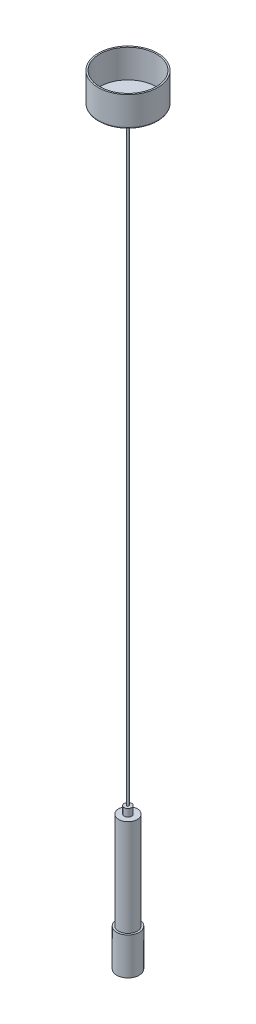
ISO-10303-21;
HEADER;
FILE_DESCRIPTION(('STEP AP214'),'2;1');
FILE_NAME('part.step','',(''),(''),'','','');
FILE_SCHEMA(('AUTOMOTIVE_DESIGN { 1 0 10303 214 1 1 1 1 }'));
ENDSEC;
DATA;
#1=APPLICATION_CONTEXT('core data for automotive mechanical design processes');
#2=APPLICATION_PROTOCOL_DEFINITION('international standard','automotive_design',2000,#1);
#3=PRODUCT_CONTEXT('',#1,'mechanical');
#4=PRODUCT('Part','Part','',(#3));
#5=PRODUCT_RELATED_PRODUCT_CATEGORY('part','',(#4));
#6=PRODUCT_DEFINITION_FORMATION('','',#4);
#7=PRODUCT_DEFINITION_CONTEXT('part definition',#1,'design');
#8=PRODUCT_DEFINITION('design','',#6,#7);
#9=PRODUCT_DEFINITION_SHAPE('','',#8);
#10=(LENGTH_UNIT() NAMED_UNIT(*) SI_UNIT(.MILLI.,.METRE.));
#11=(NAMED_UNIT(*) PLANE_ANGLE_UNIT() SI_UNIT($,.RADIAN.));
#12=(NAMED_UNIT(*) SI_UNIT($,.STERADIAN.) SOLID_ANGLE_UNIT());
#13=UNCERTAINTY_MEASURE_WITH_UNIT(LENGTH_MEASURE(1.E-05),#10,'distance_accuracy_value','');
#14=(GEOMETRIC_REPRESENTATION_CONTEXT(3) GLOBAL_UNCERTAINTY_ASSIGNED_CONTEXT((#13)) GLOBAL_UNIT_ASSIGNED_CONTEXT((#10,
#11,#12)) REPRESENTATION_CONTEXT('',''));
#15=CARTESIAN_POINT('',(0.,0.,0.));
#16=DIRECTION('',(0.,0.,1.));
#17=DIRECTION('',(1.,0.,0.));
#18=AXIS2_PLACEMENT_3D('',#15,#16,#17);
#19=CARTESIAN_POINT('',(0.,-50.,0.));
#20=DIRECTION('',(0.,1.,0.));
#21=DIRECTION('',(0.,0.,1.));
#22=AXIS2_PLACEMENT_3D('',#19,#20,#21);
#23=CYLINDRICAL_SURFACE('',#22,11.);
#24=CARTESIAN_POINT('',(0.,-50.,0.));
#25=DIRECTION('',(0.,-1.,0.));
#26=DIRECTION('',(0.,0.,-1.));
#27=AXIS2_PLACEMENT_3D('',#24,#25,#26);
#28=CIRCLE('',#27,11.);
#29=CARTESIAN_POINT('',(0.,-50.,-11.));
#30=VERTEX_POINT('',#29);
#31=EDGE_CURVE('E11',#30,#30,#28,.T.);
#32=ORIENTED_EDGE('',*,*,#31,.F.);
#33=EDGE_LOOP('',(#32));
#34=FACE_BOUND('',#33,.T.);
#35=CARTESIAN_POINT('',(0.,-47.,0.));
#36=DIRECTION('',(0.,-1.,0.));
#37=DIRECTION('',(0.,0.,-1.));
#38=AXIS2_PLACEMENT_3D('',#35,#36,#37);
#39=CIRCLE('',#38,11.);
#40=CARTESIAN_POINT('',(0.,-47.,-11.));
#41=VERTEX_POINT('',#40);
#42=EDGE_CURVE('E45',#41,#41,#39,.T.);
#43=ORIENTED_EDGE('',*,*,#42,.T.);
#44=EDGE_LOOP('',(#43));
#45=FACE_BOUND('',#44,.T.);
#46=ADVANCED_FACE('F42',(#34,#45),#23,.T.);
#47=CARTESIAN_POINT('',(0.,-50.,0.));
#48=DIRECTION('',(0.,-1.,0.));
#49=DIRECTION('',(0.,0.,-1.));
#50=AXIS2_PLACEMENT_3D('',#47,#48,#49);
#51=PLANE('',#50);
#52=ORIENTED_EDGE('',*,*,#31,.T.);
#53=EDGE_LOOP('',(#52));
#54=FACE_BOUND('',#53,.T.);
#55=ADVANCED_FACE('F57',(#54),#51,.T.);
#56=CARTESIAN_POINT('',(0.,-47.,0.));
#57=DIRECTION('',(0.,-1.,0.));
#58=DIRECTION('',(0.,0.,-1.));
#59=AXIS2_PLACEMENT_3D('',#56,#57,#58);
#60=PLANE('',#59);
#61=ORIENTED_EDGE('',*,*,#42,.F.);
#62=EDGE_LOOP('',(#61));
#63=FACE_BOUND('',#62,.T.);
#64=ADVANCED_FACE('F55',(#63),#60,.F.);
#65=CLOSED_SHELL('',(#46,#55,#64));
#66=MANIFOLD_SOLID_BREP('B2',#65);
#67=CARTESIAN_POINT('',(0.,995.,0.));
#68=DIRECTION('',(0.,-1.,0.));
#69=DIRECTION('',(0.,0.,-1.));
#70=AXIS2_PLACEMENT_3D('',#67,#68,#69);
#71=CYLINDRICAL_SURFACE('',#70,40.);
#72=CARTESIAN_POINT('',(0.,957.,0.));
#73=DIRECTION('',(0.,1.,0.));
#74=DIRECTION('',(0.,0.,1.));
#75=AXIS2_PLACEMENT_3D('',#72,#73,#74);
#76=CIRCLE('',#75,40.);
#77=CARTESIAN_POINT('',(0.,957.,40.));
#78=VERTEX_POINT('',#77);
#79=EDGE_CURVE('E97',#78,#78,#76,.T.);
#80=ORIENTED_EDGE('',*,*,#79,.T.);
#81=EDGE_LOOP('',(#80));
#82=FACE_BOUND('',#81,.T.);
#83=CARTESIAN_POINT('',(0.,995.,0.));
#84=DIRECTION('',(0.,1.,0.));
#85=DIRECTION('',(0.,0.,1.));
#86=AXIS2_PLACEMENT_3D('',#83,#84,#85);
#87=CIRCLE('',#86,40.);
#88=CARTESIAN_POINT('',(0.,995.,40.));
#89=VERTEX_POINT('',#88);
#90=EDGE_CURVE('E101',#89,#89,#87,.T.);
#91=ORIENTED_EDGE('',*,*,#90,.F.);
#92=EDGE_LOOP('',(#91));
#93=FACE_BOUND('',#92,.T.);
#94=ADVANCED_FACE('F90',(#82,#93),#71,.T.);
#95=CARTESIAN_POINT('',(0.,995.,0.));
#96=DIRECTION('',(0.,1.,0.));
#97=DIRECTION('',(0.,0.,1.));
#98=AXIS2_PLACEMENT_3D('',#95,#96,#97);
#99=PLANE('',#98);
#100=CARTESIAN_POINT('',(0.,995.,0.));
#101=DIRECTION('',(0.,1.,0.));
#102=DIRECTION('',(0.,0.,1.));
#103=AXIS2_PLACEMENT_3D('',#100,#101,#102);
#104=CIRCLE('',#103,38.);
#105=CARTESIAN_POINT('',(0.,995.,38.));
#106=VERTEX_POINT('',#105);
#107=EDGE_CURVE('E108',#106,#106,#104,.T.);
#108=ORIENTED_EDGE('',*,*,#107,.F.);
#109=EDGE_LOOP('',(#108));
#110=FACE_BOUND('',#109,.T.);
#111=ORIENTED_EDGE('',*,*,#90,.T.);
#112=EDGE_LOOP('',(#111));
#113=FACE_BOUND('',#112,.T.);
#114=ADVANCED_FACE('F122',(#110,#113),#99,.T.);
#115=CARTESIAN_POINT('',(0.,955.,0.));
#116=DIRECTION('',(0.,1.,0.));
#117=DIRECTION('',(0.,0.,1.));
#118=AXIS2_PLACEMENT_3D('',#115,#116,#117);
#119=PLANE('',#118);
#120=CARTESIAN_POINT('',(0.,955.,0.));
#121=DIRECTION('',(0.,1.,0.));
#122=DIRECTION('',(0.,0.,1.));
#123=AXIS2_PLACEMENT_3D('',#120,#121,#122);
#124=CIRCLE('',#123,38.);
#125=CARTESIAN_POINT('',(0.,955.,38.));
#126=VERTEX_POINT('',#125);
#127=EDGE_CURVE('E41',#126,#126,#124,.F.);
#128=ORIENTED_EDGE('',*,*,#127,.T.);
#129=EDGE_LOOP('',(#128));
#130=FACE_BOUND('',#129,.T.);
#131=ADVANCED_FACE('F125',(#130),#119,.F.);
#132=CARTESIAN_POINT('',(0.,957.,0.));
#133=DIRECTION('',(0.,1.,0.));
#134=DIRECTION('',(0.,0.,1.));
#135=AXIS2_PLACEMENT_3D('',#132,#133,#134);
#136=TOROIDAL_SURFACE('',#135,38.,2.);
#137=ORIENTED_EDGE('',*,*,#127,.F.);
#138=EDGE_LOOP('',(#137));
#139=FACE_BOUND('',#138,.T.);
#140=ORIENTED_EDGE('',*,*,#79,.F.);
#141=EDGE_LOOP('',(#140));
#142=FACE_BOUND('',#141,.T.);
#143=ADVANCED_FACE('F92',(#139,#142),#136,.T.);
#144=CARTESIAN_POINT('',(0.,995.,0.));
#145=DIRECTION('',(0.,-1.,0.));
#146=DIRECTION('',(0.,0.,-1.));
#147=AXIS2_PLACEMENT_3D('',#144,#145,#146);
#148=CYLINDRICAL_SURFACE('',#147,38.);
#149=CARTESIAN_POINT('',(0.,957.,0.));
#150=DIRECTION('',(0.,1.,0.));
#151=DIRECTION('',(0.,0.,1.));
#152=AXIS2_PLACEMENT_3D('',#149,#150,#151);
#153=CIRCLE('',#152,38.);
#154=CARTESIAN_POINT('',(0.,957.,38.));
#155=VERTEX_POINT('',#154);
#156=EDGE_CURVE('E105',#155,#155,#153,.T.);
#157=ORIENTED_EDGE('',*,*,#156,.F.);
#158=EDGE_LOOP('',(#157));
#159=FACE_BOUND('',#158,.T.);
#160=ORIENTED_EDGE('',*,*,#107,.T.);
#161=EDGE_LOOP('',(#160));
#162=FACE_BOUND('',#161,.T.);
#163=ADVANCED_FACE('F116',(#159,#162),#148,.F.);
#164=CARTESIAN_POINT('',(0.,957.,0.));
#165=DIRECTION('',(0.,1.,0.));
#166=DIRECTION('',(0.,0.,1.));
#167=AXIS2_PLACEMENT_3D('',#164,#165,#166);
#168=PLANE('',#167);
#169=ORIENTED_EDGE('',*,*,#156,.T.);
#170=EDGE_LOOP('',(#169));
#171=FACE_BOUND('',#170,.T.);
#172=ADVANCED_FACE('F114',(#171),#168,.T.);
#173=CLOSED_SHELL('',(#94,#114,#131,#143,#163,#172));
#174=MANIFOLD_SOLID_BREP('B6',#173);
#175=CARTESIAN_POINT('',(0.,955.,0.));
#176=DIRECTION('',(0.,-1.,0.));
#177=DIRECTION('',(0.,0.,-1.));
#178=AXIS2_PLACEMENT_3D('',#175,#176,#177);
#179=CYLINDRICAL_SURFACE('',#178,5.);
#180=CARTESIAN_POINT('',(0.,955.,0.));
#181=DIRECTION('',(0.,1.,0.));
#182=DIRECTION('',(0.,0.,1.));
#183=AXIS2_PLACEMENT_3D('',#180,#181,#182);
#184=CIRCLE('',#183,5.);
#185=CARTESIAN_POINT('',(0.,955.,5.));
#186=VERTEX_POINT('',#185);
#187=EDGE_CURVE('E89',#186,#186,#184,.T.);
#188=ORIENTED_EDGE('',*,*,#187,.F.);
#189=EDGE_LOOP('',(#188));
#190=FACE_BOUND('',#189,.T.);
#191=CARTESIAN_POINT('',(0.,940.,0.));
#192=DIRECTION('',(0.,1.,0.));
#193=DIRECTION('',(0.,0.,1.));
#194=AXIS2_PLACEMENT_3D('',#191,#192,#193);
#195=CIRCLE('',#194,5.);
#196=CARTESIAN_POINT('',(0.,940.,5.));
#197=VERTEX_POINT('',#196);
#198=EDGE_CURVE('E186',#197,#197,#195,.T.);
#199=ORIENTED_EDGE('',*,*,#198,.T.);
#200=EDGE_LOOP('',(#199));
#201=FACE_BOUND('',#200,.T.);
#202=ADVANCED_FACE('F183',(#190,#201),#179,.T.);
#203=CARTESIAN_POINT('',(0.,955.,0.));
#204=DIRECTION('',(0.,1.,0.));
#205=DIRECTION('',(0.,0.,1.));
#206=AXIS2_PLACEMENT_3D('',#203,#204,#205);
#207=PLANE('',#206);
#208=ORIENTED_EDGE('',*,*,#187,.T.);
#209=EDGE_LOOP('',(#208));
#210=FACE_BOUND('',#209,.T.);
#211=ADVANCED_FACE('F198',(#210),#207,.T.);
#212=CARTESIAN_POINT('',(0.,940.,0.));
#213=DIRECTION('',(0.,1.,0.));
#214=DIRECTION('',(0.,0.,1.));
#215=AXIS2_PLACEMENT_3D('',#212,#213,#214);
#216=PLANE('',#215);
#217=ORIENTED_EDGE('',*,*,#198,.F.);
#218=EDGE_LOOP('',(#217));
#219=FACE_BOUND('',#218,.T.);
#220=ADVANCED_FACE('F196',(#219),#216,.F.);
#221=CLOSED_SHELL('',(#202,#211,#220));
#222=MANIFOLD_SOLID_BREP('B36',#221);
#223=CARTESIAN_POINT('',(0.,940.,0.));
#224=DIRECTION('',(0.,-1.,0.));
#225=DIRECTION('',(0.,0.,-1.));
#226=AXIS2_PLACEMENT_3D('',#223,#224,#225);
#227=CYLINDRICAL_SURFACE('',#226,1.25);
#228=CARTESIAN_POINT('',(0.,940.,0.));
#229=DIRECTION('',(0.,1.,0.));
#230=DIRECTION('',(0.,0.,1.));
#231=AXIS2_PLACEMENT_3D('',#228,#229,#230);
#232=CIRCLE('',#231,1.25);
#233=CARTESIAN_POINT('',(0.,940.,1.25));
#234=VERTEX_POINT('',#233);
#235=EDGE_CURVE('E182',#234,#234,#232,.T.);
#236=ORIENTED_EDGE('',*,*,#235,.F.);
#237=EDGE_LOOP('',(#236));
#238=FACE_BOUND('',#237,.T.);
#239=CARTESIAN_POINT('',(0.,140.,0.));
#240=DIRECTION('',(0.,1.,0.));
#241=DIRECTION('',(0.,0.,1.));
#242=AXIS2_PLACEMENT_3D('',#239,#240,#241);
#243=CIRCLE('',#242,1.25);
#244=CARTESIAN_POINT('',(0.,140.,1.25));
#245=VERTEX_POINT('',#244);
#246=EDGE_CURVE('E234',#245,#245,#243,.T.);
#247=ORIENTED_EDGE('',*,*,#246,.T.);
#248=EDGE_LOOP('',(#247));
#249=FACE_BOUND('',#248,.T.);
#250=ADVANCED_FACE('F231',(#238,#249),#227,.T.);
#251=CARTESIAN_POINT('',(0.,940.,0.));
#252=DIRECTION('',(0.,1.,0.));
#253=DIRECTION('',(0.,0.,1.));
#254=AXIS2_PLACEMENT_3D('',#251,#252,#253);
#255=PLANE('',#254);
#256=ORIENTED_EDGE('',*,*,#235,.T.);
#257=EDGE_LOOP('',(#256));
#258=FACE_BOUND('',#257,.T.);
#259=ADVANCED_FACE('F246',(#258),#255,.T.);
#260=CARTESIAN_POINT('',(0.,140.,0.));
#261=DIRECTION('',(0.,1.,0.));
#262=DIRECTION('',(0.,0.,1.));
#263=AXIS2_PLACEMENT_3D('',#260,#261,#262);
#264=PLANE('',#263);
#265=ORIENTED_EDGE('',*,*,#246,.F.);
#266=EDGE_LOOP('',(#265));
#267=FACE_BOUND('',#266,.T.);
#268=ADVANCED_FACE('F244',(#267),#264,.F.);
#269=CLOSED_SHELL('',(#250,#259,#268));
#270=MANIFOLD_SOLID_BREP('B84',#269);
#271=CARTESIAN_POINT('',(0.,140.,0.));
#272=DIRECTION('',(0.,-1.,0.));
#273=DIRECTION('',(0.,0.,-1.));
#274=AXIS2_PLACEMENT_3D('',#271,#272,#273);
#275=CYLINDRICAL_SURFACE('',#274,5.);
#276=CARTESIAN_POINT('',(0.,140.,0.));
#277=DIRECTION('',(0.,1.,0.));
#278=DIRECTION('',(0.,0.,1.));
#279=AXIS2_PLACEMENT_3D('',#276,#277,#278);
#280=CIRCLE('',#279,5.);
#281=CARTESIAN_POINT('',(0.,140.,5.));
#282=VERTEX_POINT('',#281);
#283=EDGE_CURVE('E230',#282,#282,#280,.T.);
#284=ORIENTED_EDGE('',*,*,#283,.F.);
#285=EDGE_LOOP('',(#284));
#286=FACE_BOUND('',#285,.T.);
#287=CARTESIAN_POINT('',(0.,130.,0.));
#288=DIRECTION('',(0.,1.,0.));
#289=DIRECTION('',(0.,0.,1.));
#290=AXIS2_PLACEMENT_3D('',#287,#288,#289);
#291=CIRCLE('',#290,5.);
#292=CARTESIAN_POINT('',(0.,130.,5.));
#293=VERTEX_POINT('',#292);
#294=EDGE_CURVE('E282',#293,#293,#291,.T.);
#295=ORIENTED_EDGE('',*,*,#294,.T.);
#296=EDGE_LOOP('',(#295));
#297=FACE_BOUND('',#296,.T.);
#298=ADVANCED_FACE('F279',(#286,#297),#275,.T.);
#299=CARTESIAN_POINT('',(0.,140.,0.));
#300=DIRECTION('',(0.,1.,0.));
#301=DIRECTION('',(0.,0.,1.));
#302=AXIS2_PLACEMENT_3D('',#299,#300,#301);
#303=PLANE('',#302);
#304=ORIENTED_EDGE('',*,*,#283,.T.);
#305=EDGE_LOOP('',(#304));
#306=FACE_BOUND('',#305,.T.);
#307=ADVANCED_FACE('F294',(#306),#303,.T.);
#308=CARTESIAN_POINT('',(0.,130.,0.));
#309=DIRECTION('',(0.,1.,0.));
#310=DIRECTION('',(0.,0.,1.));
#311=AXIS2_PLACEMENT_3D('',#308,#309,#310);
#312=PLANE('',#311);
#313=ORIENTED_EDGE('',*,*,#294,.F.);
#314=EDGE_LOOP('',(#313));
#315=FACE_BOUND('',#314,.T.);
#316=ADVANCED_FACE('F292',(#315),#312,.F.);
#317=CLOSED_SHELL('',(#298,#307,#316));
#318=MANIFOLD_SOLID_BREP('B177',#317);
#319=CARTESIAN_POINT('',(0.,-50.,0.));
#320=DIRECTION('',(0.,1.,0.));
#321=DIRECTION('',(0.,0.,1.));
#322=AXIS2_PLACEMENT_3D('',#319,#320,#321);
#323=CYLINDRICAL_SURFACE('',#322,15.);
#324=CARTESIAN_POINT('',(0.,-50.,0.));
#325=DIRECTION('',(0.,-1.,0.));
#326=DIRECTION('',(0.,0.,-1.));
#327=AXIS2_PLACEMENT_3D('',#324,#325,#326);
#328=CIRCLE('',#327,15.);
#329=CARTESIAN_POINT('',(0.,-50.,-15.));
#330=VERTEX_POINT('',#329);
#331=EDGE_CURVE('E278',#330,#330,#328,.T.);
#332=ORIENTED_EDGE('',*,*,#331,.F.);
#333=EDGE_LOOP('',(#332));
#334=FACE_BOUND('',#333,.T.);
#335=CARTESIAN_POINT('',(0.,0.,0.));
#336=DIRECTION('',(0.,-1.,0.));
#337=DIRECTION('',(0.,0.,-1.));
#338=AXIS2_PLACEMENT_3D('',#335,#336,#337);
#339=CIRCLE('',#338,15.);
#340=CARTESIAN_POINT('',(0.,0.,-15.));
#341=VERTEX_POINT('',#340);
#342=EDGE_CURVE('E329',#341,#341,#339,.T.);
#343=ORIENTED_EDGE('',*,*,#342,.T.);
#344=EDGE_LOOP('',(#343));
#345=FACE_BOUND('',#344,.T.);
#346=ADVANCED_FACE('F326',(#334,#345),#323,.T.);
#347=CARTESIAN_POINT('',(0.,-50.,0.));
#348=DIRECTION('',(0.,-1.,0.));
#349=DIRECTION('',(0.,0.,-1.));
#350=AXIS2_PLACEMENT_3D('',#347,#348,#349);
#351=PLANE('',#350);
#352=CARTESIAN_POINT('',(0.,-50.,0.));
#353=DIRECTION('',(0.,-1.,0.));
#354=DIRECTION('',(0.,0.,-1.));
#355=AXIS2_PLACEMENT_3D('',#352,#353,#354);
#356=CIRCLE('',#355,11.);
#357=CARTESIAN_POINT('',(0.,-50.,-11.));
#358=VERTEX_POINT('',#357);
#359=EDGE_CURVE('E338',#358,#358,#356,.T.);
#360=ORIENTED_EDGE('',*,*,#359,.F.);
#361=EDGE_LOOP('',(#360));
#362=FACE_BOUND('',#361,.T.);
#363=ORIENTED_EDGE('',*,*,#331,.T.);
#364=EDGE_LOOP('',(#363));
#365=FACE_BOUND('',#364,.T.);
#366=ADVANCED_FACE('F353',(#362,#365),#351,.T.);
#367=CARTESIAN_POINT('',(0.,0.,0.));
#368=DIRECTION('',(0.,-1.,0.));
#369=DIRECTION('',(0.,0.,-1.));
#370=AXIS2_PLACEMENT_3D('',#367,#368,#369);
#371=PLANE('',#370);
#372=ORIENTED_EDGE('',*,*,#342,.F.);
#373=EDGE_LOOP('',(#372));
#374=FACE_BOUND('',#373,.T.);
#375=ADVANCED_FACE('F349',(#374),#371,.F.);
#376=CARTESIAN_POINT('',(0.,-47.,0.));
#377=DIRECTION('',(0.,-1.,0.));
#378=DIRECTION('',(0.,0.,-1.));
#379=AXIS2_PLACEMENT_3D('',#376,#377,#378);
#380=CYLINDRICAL_SURFACE('',#379,11.);
#381=CARTESIAN_POINT('',(0.,-47.,0.));
#382=DIRECTION('',(0.,-1.,0.));
#383=DIRECTION('',(0.,0.,-1.));
#384=AXIS2_PLACEMENT_3D('',#381,#382,#383);
#385=CIRCLE('',#384,11.);
#386=CARTESIAN_POINT('',(0.,-47.,-11.));
#387=VERTEX_POINT('',#386);
#388=EDGE_CURVE('E336',#387,#387,#385,.T.);
#389=ORIENTED_EDGE('',*,*,#388,.F.);
#390=EDGE_LOOP('',(#389));
#391=FACE_BOUND('',#390,.T.);
#392=ORIENTED_EDGE('',*,*,#359,.T.);
#393=EDGE_LOOP('',(#392));
#394=FACE_BOUND('',#393,.T.);
#395=ADVANCED_FACE('F346',(#391,#394),#380,.F.);
#396=CARTESIAN_POINT('',(0.,-47.,0.));
#397=DIRECTION('',(0.,-1.,0.));
#398=DIRECTION('',(0.,0.,-1.));
#399=AXIS2_PLACEMENT_3D('',#396,#397,#398);
#400=PLANE('',#399);
#401=ORIENTED_EDGE('',*,*,#388,.T.);
#402=EDGE_LOOP('',(#401));
#403=FACE_BOUND('',#402,.T.);
#404=ADVANCED_FACE('F344',(#403),#400,.T.);
#405=CLOSED_SHELL('',(#346,#366,#375,#395,#404));
#406=MANIFOLD_SOLID_BREP('B225',#405);
#407=CARTESIAN_POINT('',(0.,130.,0.));
#408=DIRECTION('',(0.,-1.,0.));
#409=DIRECTION('',(0.,0.,-1.));
#410=AXIS2_PLACEMENT_3D('',#407,#408,#409);
#411=CYLINDRICAL_SURFACE('',#410,12.5);
#412=CARTESIAN_POINT('',(0.,130.,0.));
#413=DIRECTION('',(0.,1.,0.));
#414=DIRECTION('',(0.,0.,1.));
#415=AXIS2_PLACEMENT_3D('',#412,#413,#414);
#416=CIRCLE('',#415,12.5);
#417=CARTESIAN_POINT('',(0.,130.,12.5));
#418=VERTEX_POINT('',#417);
#419=EDGE_CURVE('E325',#418,#418,#416,.T.);
#420=ORIENTED_EDGE('',*,*,#419,.F.);
#421=EDGE_LOOP('',(#420));
#422=FACE_BOUND('',#421,.T.);
#423=CARTESIAN_POINT('',(0.,0.,0.));
#424=DIRECTION('',(0.,1.,0.));
#425=DIRECTION('',(0.,0.,1.));
#426=AXIS2_PLACEMENT_3D('',#423,#424,#425);
#427=CIRCLE('',#426,12.5);
#428=CARTESIAN_POINT('',(0.,0.,12.5));
#429=VERTEX_POINT('',#428);
#430=EDGE_CURVE('E399',#429,#429,#427,.T.);
#431=ORIENTED_EDGE('',*,*,#430,.T.);
#432=EDGE_LOOP('',(#431));
#433=FACE_BOUND('',#432,.T.);
#434=ADVANCED_FACE('F396',(#422,#433),#411,.T.);
#435=CARTESIAN_POINT('',(0.,130.,0.));
#436=DIRECTION('',(0.,1.,0.));
#437=DIRECTION('',(0.,0.,1.));
#438=AXIS2_PLACEMENT_3D('',#435,#436,#437);
#439=PLANE('',#438);
#440=ORIENTED_EDGE('',*,*,#419,.T.);
#441=EDGE_LOOP('',(#440));
#442=FACE_BOUND('',#441,.T.);
#443=ADVANCED_FACE('F411',(#442),#439,.T.);
#444=CARTESIAN_POINT('',(0.,0.,0.));
#445=DIRECTION('',(0.,1.,0.));
#446=DIRECTION('',(0.,0.,1.));
#447=AXIS2_PLACEMENT_3D('',#444,#445,#446);
#448=PLANE('',#447);
#449=ORIENTED_EDGE('',*,*,#430,.F.);
#450=EDGE_LOOP('',(#449));
#451=FACE_BOUND('',#450,.T.);
#452=ADVANCED_FACE('F409',(#451),#448,.F.);
#453=CLOSED_SHELL('',(#434,#443,#452));
#454=MANIFOLD_SOLID_BREP('B273',#453);
#455=ADVANCED_BREP_SHAPE_REPRESENTATION('',(#18,#66,#174,#222,#270,#318,#406,#454),#14);
#456=SHAPE_DEFINITION_REPRESENTATION(#9,#455);
ENDSEC;
END-ISO-10303-21;
